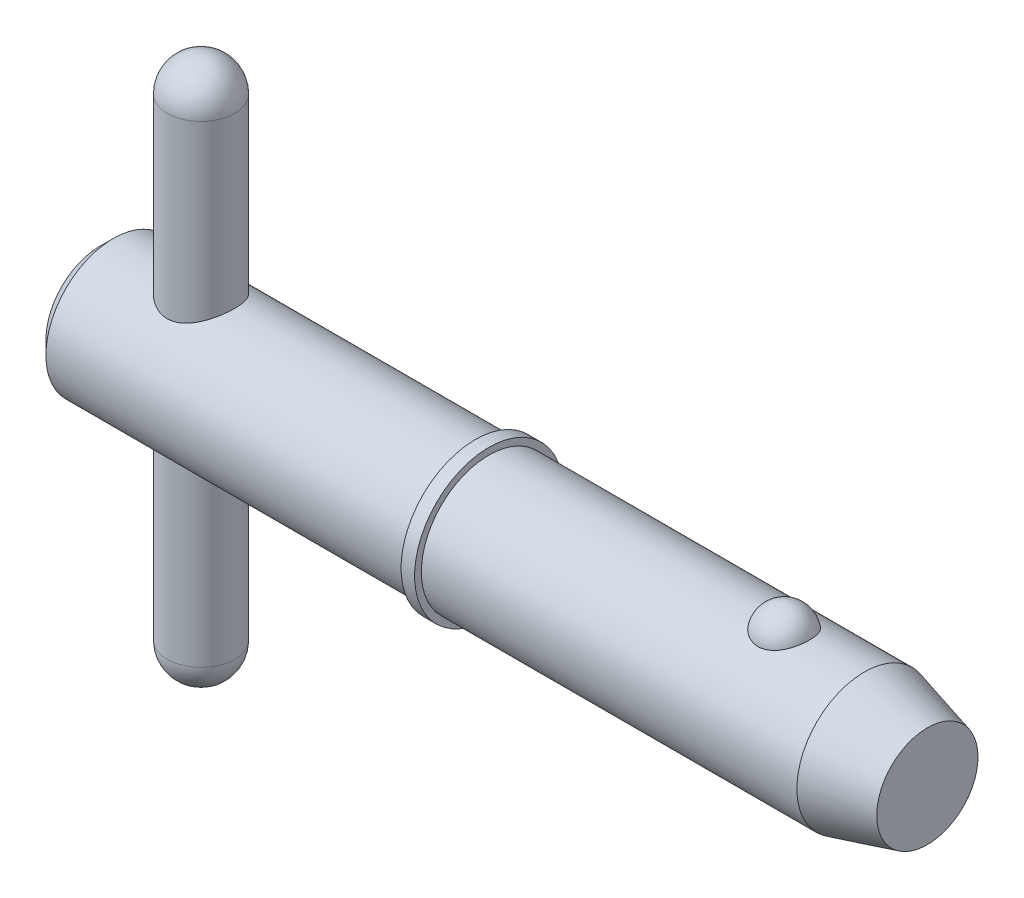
ISO-10303-21;
HEADER;
FILE_DESCRIPTION(('STEP AP214'),'2;1');
FILE_NAME('part.step','',(''),(''),'','','');
FILE_SCHEMA(('AUTOMOTIVE_DESIGN { 1 0 10303 214 1 1 1 1 }'));
ENDSEC;
DATA;
#1=APPLICATION_CONTEXT('core data for automotive mechanical design processes');
#2=APPLICATION_PROTOCOL_DEFINITION('international standard','automotive_design',2000,#1);
#3=PRODUCT_CONTEXT('',#1,'mechanical');
#4=PRODUCT('Part','Part','',(#3));
#5=PRODUCT_RELATED_PRODUCT_CATEGORY('part','',(#4));
#6=PRODUCT_DEFINITION_FORMATION('','',#4);
#7=PRODUCT_DEFINITION_CONTEXT('part definition',#1,'design');
#8=PRODUCT_DEFINITION('design','',#6,#7);
#9=PRODUCT_DEFINITION_SHAPE('','',#8);
#10=(LENGTH_UNIT() NAMED_UNIT(*) SI_UNIT(.MILLI.,.METRE.));
#11=(NAMED_UNIT(*) PLANE_ANGLE_UNIT() SI_UNIT($,.RADIAN.));
#12=(NAMED_UNIT(*) SI_UNIT($,.STERADIAN.) SOLID_ANGLE_UNIT());
#13=UNCERTAINTY_MEASURE_WITH_UNIT(LENGTH_MEASURE(1.E-05),#10,'distance_accuracy_value','');
#14=(GEOMETRIC_REPRESENTATION_CONTEXT(3) GLOBAL_UNCERTAINTY_ASSIGNED_CONTEXT((#13)) GLOBAL_UNIT_ASSIGNED_CONTEXT((#10,
#11,#12)) REPRESENTATION_CONTEXT('',''));
#15=CARTESIAN_POINT('',(0.,0.,0.));
#16=DIRECTION('',(0.,0.,1.));
#17=DIRECTION('',(1.,0.,0.));
#18=AXIS2_PLACEMENT_3D('',#15,#16,#17);
#19=CARTESIAN_POINT('',(4.755,12.7,0.));
#20=DIRECTION('',(0.,-1.,0.));
#21=DIRECTION('',(0.,0.,-1.));
#22=AXIS2_PLACEMENT_3D('',#19,#20,#21);
#23=CYLINDRICAL_SURFACE('',#22,1.585);
#24=CARTESIAN_POINT('',(4.755,-11.115,0.));
#25=DIRECTION('',(0.,-1.,0.));
#26=DIRECTION('',(0.,0.,-1.));
#27=AXIS2_PLACEMENT_3D('',#24,#25,#26);
#28=CIRCLE('',#27,1.585);
#29=CARTESIAN_POINT('',(4.755,-11.115,-1.585));
#30=VERTEX_POINT('',#29);
#31=EDGE_CURVE('P0_E10',#30,#30,#28,.F.);
#32=ORIENTED_EDGE('',*,*,#31,.T.);
#33=EDGE_LOOP('',(#32));
#34=FACE_BOUND('',#33,.T.);
#35=CARTESIAN_POINT('',(4.755,11.115,0.));
#36=DIRECTION('',(0.,-1.,0.));
#37=DIRECTION('',(0.,0.,-1.));
#38=AXIS2_PLACEMENT_3D('',#35,#36,#37);
#39=CIRCLE('',#38,1.585);
#40=CARTESIAN_POINT('',(4.755,11.115,-1.585));
#41=VERTEX_POINT('',#40);
#42=EDGE_CURVE('P0_E21',#41,#41,#39,.T.);
#43=ORIENTED_EDGE('',*,*,#42,.T.);
#44=EDGE_LOOP('',(#43));
#45=FACE_BOUND('',#44,.T.);
#46=ADVANCED_FACE('P0_F14',(#34,#45),#23,.T.);
#47=CARTESIAN_POINT('',(4.755,-11.115,0.));
#48=DIRECTION('',(0.,0.,1.));
#49=DIRECTION('',(1.,0.,0.));
#50=AXIS2_PLACEMENT_3D('',#47,#48,#49);
#51=SPHERICAL_SURFACE('',#50,1.585);
#52=CARTESIAN_POINT('',(4.755,-11.115,0.));
#53=DIRECTION('',(0.,-1.,0.));
#54=DIRECTION('',(0.,0.,-1.));
#55=AXIS2_PLACEMENT_3D('',#52,#53,#54);
#56=SPHERICAL_SURFACE('',#55,1.585);
#57=ORIENTED_EDGE('',*,*,#31,.F.);
#58=EDGE_LOOP('',(#57));
#59=FACE_BOUND('',#58,.T.);
#60=ADVANCED_FACE('P0_F29',(#59),#56,.T.);
#61=CARTESIAN_POINT('',(4.755,11.115,0.));
#62=DIRECTION('',(0.,0.,1.));
#63=DIRECTION('',(1.,0.,0.));
#64=AXIS2_PLACEMENT_3D('',#61,#62,#63);
#65=SPHERICAL_SURFACE('',#64,1.585);
#66=CARTESIAN_POINT('',(4.755,11.115,0.));
#67=DIRECTION('',(0.,-1.,0.));
#68=DIRECTION('',(0.,0.,-1.));
#69=AXIS2_PLACEMENT_3D('',#66,#67,#68);
#70=SPHERICAL_SURFACE('',#69,1.585);
#71=ORIENTED_EDGE('',*,*,#42,.F.);
#72=EDGE_LOOP('',(#71));
#73=FACE_BOUND('',#72,.T.);
#74=ADVANCED_FACE('P0_F16',(#73),#70,.T.);
#75=CLOSED_SHELL('',(#46,#60,#74));
#76=MANIFOLD_SOLID_BREP('P0_B1',#75);
#77=CARTESIAN_POINT('',(0.,0.,0.));
#78=DIRECTION('',(1.,0.,0.));
#79=DIRECTION('',(0.,0.,-1.));
#80=AXIS2_PLACEMENT_3D('',#77,#78,#79);
#81=CYLINDRICAL_SURFACE('',#80,3.175);
#82=CARTESIAN_POINT('',(35.9476846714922,0.,0.));
#83=DIRECTION('',(1.,0.,0.));
#84=DIRECTION('',(0.,0.,-1.));
#85=AXIS2_PLACEMENT_3D('',#82,#83,#84);
#86=CIRCLE('',#85,3.175);
#87=CARTESIAN_POINT('',(35.9476846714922,0.,-3.175));
#88=VERTEX_POINT('',#87);
#89=EDGE_CURVE('P1_E81',#88,#88,#86,.T.);
#90=ORIENTED_EDGE('',*,*,#89,.F.);
#91=EDGE_LOOP('',(#90));
#92=FACE_BOUND('',#91,.T.);
#93=CARTESIAN_POINT('',(18.29,0.,0.));
#94=DIRECTION('',(1.,0.,0.));
#95=DIRECTION('',(0.,0.,-1.));
#96=AXIS2_PLACEMENT_3D('',#93,#94,#95);
#97=CIRCLE('',#96,3.175);
#98=CARTESIAN_POINT('',(18.29,0.,-3.175));
#99=VERTEX_POINT('',#98);
#100=EDGE_CURVE('P1_E85',#99,#99,#97,.T.);
#101=ORIENTED_EDGE('',*,*,#100,.T.);
#102=EDGE_LOOP('',(#101));
#103=FACE_BOUND('',#102,.T.);
#104=CARTESIAN_POINT('',(32.1757276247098,2.92898950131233,1.2254164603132));
#105=CARTESIAN_POINT('',(32.112316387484,2.92899434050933,1.22541146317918));
#106=CARTESIAN_POINT('',(32.0487979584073,2.93112688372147,1.2203464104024));
#107=CARTESIAN_POINT('',(31.9235306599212,2.93942752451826,1.20020949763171));
#108=CARTESIAN_POINT('',(31.8617869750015,2.9456063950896,1.18511092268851));
#109=CARTESIAN_POINT('',(31.7420651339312,2.96127115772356,1.14540352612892));
#110=CARTESIAN_POINT('',(31.6840775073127,2.97074831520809,1.12081980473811));
#111=CARTESIAN_POINT('',(31.5731943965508,2.99197584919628,1.06285154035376));
#112=CARTESIAN_POINT('',(31.5202966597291,3.0037252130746,1.0294709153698));
#113=CARTESIAN_POINT('',(31.4192688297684,3.02865714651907,0.95367409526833));
#114=CARTESIAN_POINT('',(31.371324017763,3.04187163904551,0.911021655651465));
#115=CARTESIAN_POINT('',(31.2830360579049,3.06808741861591,0.818400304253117));
#116=CARTESIAN_POINT('',(31.2426952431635,3.08108863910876,0.768429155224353));
#117=CARTESIAN_POINT('',(31.1688039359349,3.10614903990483,0.660064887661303));
#118=CARTESIAN_POINT('',(31.1356330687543,3.11814104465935,0.601396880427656));
#119=CARTESIAN_POINT('',(31.0791190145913,3.13926931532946,0.479026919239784));
#120=CARTESIAN_POINT('',(31.0557764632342,3.14840539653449,0.415324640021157));
#121=CARTESIAN_POINT('',(31.0191785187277,3.16298160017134,0.283885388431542));
#122=CARTESIAN_POINT('',(31.0060407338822,3.16837855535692,0.216110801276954));
#123=CARTESIAN_POINT('',(30.9905676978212,3.17475386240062,0.0791367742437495));
#124=CARTESIAN_POINT('',(30.988232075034,3.17573236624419,0.00993738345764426));
#125=CARTESIAN_POINT('',(30.994388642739,3.17318075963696,-0.127420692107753));
#126=CARTESIAN_POINT('',(31.0028073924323,3.16968122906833,-0.195583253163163));
#127=CARTESIAN_POINT('',(31.0301752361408,3.1585790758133,-0.329413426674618));
#128=CARTESIAN_POINT('',(31.0491245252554,3.15097637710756,-0.395080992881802));
#129=CARTESIAN_POINT('',(31.0972057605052,3.13242485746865,-0.522180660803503));
#130=CARTESIAN_POINT('',(31.1263524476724,3.12147119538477,-0.583606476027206));
#131=CARTESIAN_POINT('',(31.1942352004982,3.09734973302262,-0.700436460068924));
#132=CARTESIAN_POINT('',(31.232972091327,3.08418174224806,-0.755840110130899));
#133=CARTESIAN_POINT('',(31.3194771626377,3.05694884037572,-0.859404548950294));
#134=CARTESIAN_POINT('',(31.3672961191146,3.04287919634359,-0.907521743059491));
#135=CARTESIAN_POINT('',(31.4707353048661,3.01548927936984,-0.994758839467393));
#136=CARTESIAN_POINT('',(31.5263549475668,3.00216895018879,-1.03387941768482));
#137=CARTESIAN_POINT('',(31.6428093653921,2.97810316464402,-1.10126594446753));
#138=CARTESIAN_POINT('',(31.7035182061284,2.96731170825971,-1.12973256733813));
#139=CARTESIAN_POINT('',(31.8293712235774,2.9492893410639,-1.17598467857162));
#140=CARTESIAN_POINT('',(31.8945137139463,2.94205708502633,-1.19377420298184));
#141=CARTESIAN_POINT('',(32.0238562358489,2.93233065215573,-1.21746387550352));
#142=CARTESIAN_POINT('',(32.0879385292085,2.92961621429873,-1.22391763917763));
#143=CARTESIAN_POINT('',(32.2163375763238,2.92855752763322,-1.22644976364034));
#144=CARTESIAN_POINT('',(32.2806542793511,2.93021238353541,-1.22253024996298));
#145=CARTESIAN_POINT('',(32.4055239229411,2.9375685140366,-1.20474140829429));
#146=CARTESIAN_POINT('',(32.466131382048,2.94313790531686,-1.19119621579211));
#147=CARTESIAN_POINT('',(32.5841106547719,2.95756226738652,-1.15491492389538));
#148=CARTESIAN_POINT('',(32.6414822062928,2.96641750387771,-1.13217808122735));
#149=CARTESIAN_POINT('',(32.7527699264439,2.98669918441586,-1.07755083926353));
#150=CARTESIAN_POINT('',(32.8065845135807,2.9981771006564,-1.0454730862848));
#151=CARTESIAN_POINT('',(32.9081473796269,3.02240235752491,-0.973220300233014));
#152=CARTESIAN_POINT('',(32.9558942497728,3.03514999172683,-0.933043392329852));
#153=CARTESIAN_POINT('',(33.0465817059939,3.06131230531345,-0.843372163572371));
#154=CARTESIAN_POINT('',(33.0891588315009,3.07472822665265,-0.793510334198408));
#155=CARTESIAN_POINT('',(33.1656765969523,3.10021106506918,-0.687241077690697));
#156=CARTESIAN_POINT('',(33.1996156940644,3.1122777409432,-0.630832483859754));
#157=CARTESIAN_POINT('',(33.2591209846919,3.134208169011,-0.511059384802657));
#158=CARTESIAN_POINT('',(33.2843892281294,3.14399040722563,-0.447531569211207));
#159=CARTESIAN_POINT('',(33.3245117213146,3.15983820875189,-0.316827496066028));
#160=CARTESIAN_POINT('',(33.3393659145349,3.16590375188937,-0.249651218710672));
#161=CARTESIAN_POINT('',(33.358358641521,3.17370076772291,-0.11354918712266));
#162=CARTESIAN_POINT('',(33.3624966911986,3.17543204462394,-0.0446233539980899));
#163=CARTESIAN_POINT('',(33.3599697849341,3.17438372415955,0.0929938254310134));
#164=CARTESIAN_POINT('',(33.3533050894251,3.17160423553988,0.161685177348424));
#165=CARTESIAN_POINT('',(33.3293754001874,3.1618438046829,0.296502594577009));
#166=CARTESIAN_POINT('',(33.3121674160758,3.15488546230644,0.362640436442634));
#167=CARTESIAN_POINT('',(33.267547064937,3.13748892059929,0.490896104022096));
#168=CARTESIAN_POINT('',(33.2401339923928,3.12705048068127,0.553013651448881));
#169=CARTESIAN_POINT('',(33.1754626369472,3.10369139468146,0.671876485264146));
#170=CARTESIAN_POINT('',(33.1381467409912,3.0907563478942,0.728587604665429));
#171=CARTESIAN_POINT('',(33.0545246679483,3.06381731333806,0.834653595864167));
#172=CARTESIAN_POINT('',(33.0082189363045,3.04981337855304,0.884008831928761));
#173=CARTESIAN_POINT('',(32.9077184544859,3.02230423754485,0.973916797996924));
#174=CARTESIAN_POINT('',(32.853535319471,3.00879833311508,1.01448227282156));
#175=CARTESIAN_POINT('',(32.7385299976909,2.98383625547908,1.0857155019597));
#176=CARTESIAN_POINT('',(32.6777053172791,2.9723808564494,1.11637952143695));
#177=CARTESIAN_POINT('',(32.5533690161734,2.95329063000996,1.16592590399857));
#178=CARTESIAN_POINT('',(32.4900230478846,2.9455373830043,1.18517901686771));
#179=CARTESIAN_POINT('',(32.3607664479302,2.9342556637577,1.21284802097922));
#180=CARTESIAN_POINT('',(32.2948641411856,2.93071450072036,1.2212964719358));
#181=CARTESIAN_POINT('',(32.211116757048,2.9291525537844,1.22502505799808));
#182=CARTESIAN_POINT('',(32.1934263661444,2.92898815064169,1.22541785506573));
#183=CARTESIAN_POINT('',(32.1757276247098,2.92898950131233,1.2254164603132));
#184=B_SPLINE_CURVE_WITH_KNOTS('',3,(#104,#105,#106,#107,#108,#109,#110,#111,#112,#113,#114,
#115,#116,#117,#118,#119,#120,#121,#122,#123,#124,#125,#126,#127,#128,#129,#130,#131,#132,#133,
#134,#135,#136,#137,#138,#139,#140,#141,#142,#143,#144,#145,#146,#147,#148,#149,#150,#151,#152,
#153,#154,#155,#156,#157,#158,#159,#160,#161,#162,#163,#164,#165,#166,#167,#168,#169,#170,#171,
#172,#173,#174,#175,#176,#177,#178,#179,#180,#181,#182,#183),.UNSPECIFIED.,.T.,.F.,(4,2,2,2,2,2,
2,2,2,2,2,2,2,2,2,2,2,2,2,2,2,2,2,2,2,2,2,2,2,2,2,2,2,2,2,2,2,2,2,4),(0.,0.190186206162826,
0.380880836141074,0.571074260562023,0.761183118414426,0.956866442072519,1.1526097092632,
1.3570177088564,1.56143892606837,1.76818248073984,1.97491892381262,2.18025109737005,
2.38558707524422,2.59122111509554,2.79687285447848,3.00371012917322,3.2105318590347,
3.41323429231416,3.61586005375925,3.80828192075,4.00066436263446,4.18685798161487,
4.37306665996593,4.56330302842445,4.75358348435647,4.95345287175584,5.15335793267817,
5.35957003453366,5.56578325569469,5.77200579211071,5.97822335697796,6.183335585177,
6.38846199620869,6.59480900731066,6.80114579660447,7.00718137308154,7.21329457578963,
7.41228022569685,7.61066481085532,7.66374777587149),.UNSPECIFIED.);
#185=CARTESIAN_POINT('',(32.1757276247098,2.92898950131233,1.2254164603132));
#186=VERTEX_POINT('',#185);
#187=EDGE_CURVE('P1_E35',#186,#186,#184,.T.);
#188=ORIENTED_EDGE('',*,*,#187,.T.);
#189=EDGE_LOOP('',(#188));
#190=FACE_BOUND('',#189,.T.);
#191=ADVANCED_FACE('P1_F13',(#92,#103,#190),#81,.T.);
#192=CARTESIAN_POINT('',(0.,0.,0.));
#193=DIRECTION('',(-1.,0.,0.));
#194=DIRECTION('',(0.,0.,1.));
#195=AXIS2_PLACEMENT_3D('',#192,#193,#194);
#196=PLANE('',#195);
#197=CARTESIAN_POINT('',(0.,0.,0.));
#198=DIRECTION('',(1.,0.,0.));
#199=DIRECTION('',(0.,0.,-1.));
#200=AXIS2_PLACEMENT_3D('',#197,#198,#199);
#201=CIRCLE('',#200,2.54);
#202=CARTESIAN_POINT('',(0.,0.,-2.54));
#203=VERTEX_POINT('',#202);
#204=EDGE_CURVE('P1_E9',#203,#203,#201,.T.);
#205=ORIENTED_EDGE('',*,*,#204,.F.);
#206=EDGE_LOOP('',(#205));
#207=FACE_BOUND('',#206,.T.);
#208=ADVANCED_FACE('P1_F15',(#207),#196,.T.);
#209=CARTESIAN_POINT('',(0.634999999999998,0.,0.));
#210=DIRECTION('',(1.,0.,0.));
#211=DIRECTION('',(0.,0.,-1.));
#212=AXIS2_PLACEMENT_3D('',#209,#210,#211);
#213=CONICAL_SURFACE('',#212,3.175,0.78539816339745);
#214=ORIENTED_EDGE('',*,*,#204,.T.);
#215=EDGE_LOOP('',(#214));
#216=FACE_BOUND('',#215,.T.);
#217=CARTESIAN_POINT('',(0.634999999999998,0.,0.));
#218=DIRECTION('',(1.,0.,0.));
#219=DIRECTION('',(0.,0.,-1.));
#220=AXIS2_PLACEMENT_3D('',#217,#218,#219);
#221=CIRCLE('',#220,3.175);
#222=CARTESIAN_POINT('',(0.634999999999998,0.,-3.175));
#223=VERTEX_POINT('',#222);
#224=EDGE_CURVE('P1_E26',#223,#223,#221,.T.);
#225=ORIENTED_EDGE('',*,*,#224,.F.);
#226=EDGE_LOOP('',(#225));
#227=FACE_BOUND('',#226,.T.);
#228=ADVANCED_FACE('P1_F77',(#216,#227),#213,.T.);
#229=CARTESIAN_POINT('',(0.,0.,0.));
#230=DIRECTION('',(1.,0.,0.));
#231=DIRECTION('',(0.,0.,-1.));
#232=AXIS2_PLACEMENT_3D('',#229,#230,#231);
#233=CYLINDRICAL_SURFACE('',#232,3.175);
#234=CARTESIAN_POINT('',(4.755,-2.75107251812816,1.585));
#235=CARTESIAN_POINT('',(4.67238891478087,-2.7510796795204,1.58499425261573));
#236=CARTESIAN_POINT('',(4.58967306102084,-2.75485010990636,1.57849830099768));
#237=CARTESIAN_POINT('',(4.42677850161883,-2.76938647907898,1.55284486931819));
#238=CARTESIAN_POINT('',(4.34660551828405,-2.78016716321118,1.53366069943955));
#239=CARTESIAN_POINT('',(4.19146029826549,-2.80716278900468,1.48366329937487));
#240=CARTESIAN_POINT('',(4.11646293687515,-2.8233488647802,1.45291173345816));
#241=CARTESIAN_POINT('',(3.97271079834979,-2.85928672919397,1.38084067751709));
#242=CARTESIAN_POINT('',(3.90395634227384,-2.87903870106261,1.33952064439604));
#243=CARTESIAN_POINT('',(3.76839976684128,-2.921867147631,1.24350234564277));
#244=CARTESIAN_POINT('',(3.702222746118,-2.94508343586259,1.18798355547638));
#245=CARTESIAN_POINT('',(3.5796334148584,-2.99109588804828,1.06685014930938));
#246=CARTESIAN_POINT('',(3.52322596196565,-3.01389183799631,1.00123054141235));
#247=CARTESIAN_POINT('',(3.41807024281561,-3.05832598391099,0.856373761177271));
#248=CARTESIAN_POINT('',(3.37009053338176,-3.07978367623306,0.776518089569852));
#249=CARTESIAN_POINT('',(3.28853137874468,-3.11730894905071,0.608596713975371));
#250=CARTESIAN_POINT('',(3.25494287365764,-3.1333799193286,0.520536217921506));
#251=CARTESIAN_POINT('',(3.20559401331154,-3.15731341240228,0.345327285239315));
#252=CARTESIAN_POINT('',(3.18873760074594,-3.16567752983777,0.258557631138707));
#253=CARTESIAN_POINT('',(3.16972238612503,-3.17512718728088,0.0830496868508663));
#254=CARTESIAN_POINT('',(3.16755472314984,-3.17621711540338,-0.00568738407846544));
#255=CARTESIAN_POINT('',(3.1775542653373,-3.17123385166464,-0.174372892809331));
#256=CARTESIAN_POINT('',(3.18849502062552,-3.16577346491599,-0.254416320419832));
#257=CARTESIAN_POINT('',(3.22220680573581,-3.14922844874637,-0.411354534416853));
#258=CARTESIAN_POINT('',(3.2449787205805,-3.13814339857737,-0.488249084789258));
#259=CARTESIAN_POINT('',(3.30185558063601,-3.111172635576,-0.638050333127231));
#260=CARTESIAN_POINT('',(3.33611332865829,-3.09522247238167,-0.710886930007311));
#261=CARTESIAN_POINT('',(3.41477890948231,-3.05996035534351,-0.849953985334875));
#262=CARTESIAN_POINT('',(3.45919037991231,-3.04064719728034,-0.916182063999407));
#263=CARTESIAN_POINT('',(3.5617148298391,-2.99832415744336,-1.04681642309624));
#264=CARTESIAN_POINT('',(3.62072497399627,-2.97513741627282,-1.11046186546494));
#265=CARTESIAN_POINT('',(3.7483697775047,-2.92885066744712,-1.22736291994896));
#266=CARTESIAN_POINT('',(3.81701173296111,-2.90575073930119,-1.2806105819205));
#267=CARTESIAN_POINT('',(3.96727993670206,-2.86067370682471,-1.37849835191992));
#268=CARTESIAN_POINT('',(4.04945242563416,-2.83885964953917,-1.42238246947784));
#269=CARTESIAN_POINT('',(4.2213558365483,-2.80110454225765,-1.49537418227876));
#270=CARTESIAN_POINT('',(4.3110787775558,-2.78515738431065,-1.52449715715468));
#271=CARTESIAN_POINT('',(4.48806324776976,-2.76271292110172,-1.56478065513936));
#272=CARTESIAN_POINT('',(4.57495732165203,-2.75556745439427,-1.57718067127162));
#273=CARTESIAN_POINT('',(4.74985771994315,-2.74969306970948,-1.58740564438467));
#274=CARTESIAN_POINT('',(4.8378632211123,-2.75095824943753,-1.58524082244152));
#275=CARTESIAN_POINT('',(5.00227282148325,-2.76107477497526,-1.56753530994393));
#276=CARTESIAN_POINT('',(5.07889680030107,-2.76908515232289,-1.55347662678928));
#277=CARTESIAN_POINT('',(5.22855309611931,-2.79054849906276,-1.51458035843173));
#278=CARTESIAN_POINT('',(5.30158424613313,-2.80400322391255,-1.489739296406));
#279=CARTESIAN_POINT('',(5.44583114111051,-2.83556995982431,-1.42877335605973));
#280=CARTESIAN_POINT('',(5.51680600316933,-2.85386886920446,-1.39217900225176));
#281=CARTESIAN_POINT('',(5.6520174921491,-2.89289503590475,-1.30915485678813));
#282=CARTESIAN_POINT('',(5.71625063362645,-2.91362353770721,-1.26272001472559));
#283=CARTESIAN_POINT('',(5.8445938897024,-2.95830220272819,-1.15451693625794));
#284=CARTESIAN_POINT('',(5.90767560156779,-2.98233004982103,-1.09155543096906));
#285=CARTESIAN_POINT('',(6.0226995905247,-3.02864458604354,-0.955560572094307));
#286=CARTESIAN_POINT('',(6.07463814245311,-3.05093069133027,-0.882523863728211));
#287=CARTESIAN_POINT('',(6.16704288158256,-3.09200671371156,-0.725836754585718));
#288=CARTESIAN_POINT('',(6.20717458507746,-3.11069030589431,-0.64195924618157));
#289=CARTESIAN_POINT('',(6.27235859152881,-3.1416474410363,-0.467442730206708));
#290=CARTESIAN_POINT('',(6.29742409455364,-3.15392659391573,-0.376809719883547));
#291=CARTESIAN_POINT('',(6.32960989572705,-3.16979844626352,-0.200314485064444));
#292=CARTESIAN_POINT('',(6.33816324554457,-3.17408359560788,-0.114775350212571));
#293=CARTESIAN_POINT('',(6.34130309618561,-3.17565001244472,0.0566108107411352));
#294=CARTESIAN_POINT('',(6.33589445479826,-3.17293371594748,0.142457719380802));
#295=CARTESIAN_POINT('',(6.31221457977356,-3.16120608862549,0.306097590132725));
#296=CARTESIAN_POINT('',(6.2948097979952,-3.15261910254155,0.38404960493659));
#297=CARTESIAN_POINT('',(6.24879775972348,-3.13040364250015,0.535801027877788));
#298=CARTESIAN_POINT('',(6.22018889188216,-3.11677444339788,0.609599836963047));
#299=CARTESIAN_POINT('',(6.15130303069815,-3.08497808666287,0.754502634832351));
#300=CARTESIAN_POINT('',(6.11057850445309,-3.0666414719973,0.82535556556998));
#301=CARTESIAN_POINT('',(6.01917980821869,-3.02735012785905,0.95951596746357));
#302=CARTESIAN_POINT('',(5.96850106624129,-3.00639419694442,1.02281994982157));
#303=CARTESIAN_POINT('',(5.8528006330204,-2.96149402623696,1.1467073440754));
#304=CARTESIAN_POINT('',(5.78685463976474,-2.93745961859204,1.20639723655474));
#305=CARTESIAN_POINT('',(5.64552278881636,-2.89084502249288,1.31419099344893));
#306=CARTESIAN_POINT('',(5.57012871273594,-2.8682661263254,1.36228466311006));
#307=CARTESIAN_POINT('',(5.40892145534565,-2.82661780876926,1.44677201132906));
#308=CARTESIAN_POINT('',(5.32285703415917,-2.80767948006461,1.48275497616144));
#309=CARTESIAN_POINT('',(5.14469010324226,-2.77716572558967,1.53916557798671));
#310=CARTESIAN_POINT('',(5.05260892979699,-2.76556569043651,1.55964525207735));
#311=CARTESIAN_POINT('',(4.92544162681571,-2.75613775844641,1.57618070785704));
#312=CARTESIAN_POINT('',(4.89147210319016,-2.75424493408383,1.57948285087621));
#313=CARTESIAN_POINT('',(4.82334103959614,-2.75171079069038,1.58389375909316));
#314=CARTESIAN_POINT('',(4.78917948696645,-2.75106955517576,1.58500237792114));
#315=CARTESIAN_POINT('',(4.755,-2.75107251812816,1.585));
#316=B_SPLINE_CURVE_WITH_KNOTS('',3,(#234,#235,#236,#237,#238,#239,#240,#241,#242,#243,#244,
#245,#246,#247,#248,#249,#250,#251,#252,#253,#254,#255,#256,#257,#258,#259,#260,#261,#262,#263,
#264,#265,#266,#267,#268,#269,#270,#271,#272,#273,#274,#275,#276,#277,#278,#279,#280,#281,#282,
#283,#284,#285,#286,#287,#288,#289,#290,#291,#292,#293,#294,#295,#296,#297,#298,#299,#300,#301,
#302,#303,#304,#305,#306,#307,#308,#309,#310,#311,#312,#313,#314,#315),.UNSPECIFIED.,.T.,.F.,(4,
2,2,2,2,2,2,2,2,2,2,2,2,2,2,2,2,2,2,2,2,2,2,2,2,2,2,2,2,2,2,2,2,2,2,2,2,2,2,2,4),(0.,
0.247689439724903,0.495901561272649,0.742808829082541,0.989728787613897,1.25694656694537,
1.52429683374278,1.80959781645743,2.0947189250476,2.35960564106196,2.62433255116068,
2.86610932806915,3.1079041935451,3.35305262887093,3.59828902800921,3.86665310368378,
4.13522157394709,4.4207514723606,4.70598326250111,4.9686344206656,5.23110127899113,
5.46499114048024,5.69895647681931,5.94376186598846,6.1886932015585,6.46438263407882,
6.74016408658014,7.0231370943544,7.30586181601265,7.5626977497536,7.81944433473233,
8.05935987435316,8.29930993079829,8.54954401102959,8.79989329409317,9.07508848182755,
9.35052473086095,9.63453318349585,9.91758407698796,10.0200561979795,10.1225351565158),.UNSPECIFIED.);
#317=CARTESIAN_POINT('',(4.755,-2.75107251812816,1.585));
#318=VERTEX_POINT('',#317);
#319=EDGE_CURVE('P1_E17',#318,#318,#316,.T.);
#320=ORIENTED_EDGE('',*,*,#319,.F.);
#321=EDGE_LOOP('',(#320));
#322=FACE_BOUND('',#321,.T.);
#323=CARTESIAN_POINT('',(4.755,2.75107251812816,1.585));
#324=CARTESIAN_POINT('',(4.83761108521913,2.7510796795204,1.58499425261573));
#325=CARTESIAN_POINT('',(4.92032693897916,2.75485010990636,1.57849830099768));
#326=CARTESIAN_POINT('',(5.08322149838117,2.76938647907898,1.55284486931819));
#327=CARTESIAN_POINT('',(5.16339448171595,2.78016716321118,1.53366069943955));
#328=CARTESIAN_POINT('',(5.31853970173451,2.80716278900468,1.48366329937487));
#329=CARTESIAN_POINT('',(5.39353706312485,2.8233488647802,1.45291173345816));
#330=CARTESIAN_POINT('',(5.53728920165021,2.85928672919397,1.38084067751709));
#331=CARTESIAN_POINT('',(5.60604365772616,2.87903870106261,1.33952064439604));
#332=CARTESIAN_POINT('',(5.74160023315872,2.921867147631,1.24350234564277));
#333=CARTESIAN_POINT('',(5.807777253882,2.94508343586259,1.18798355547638));
#334=CARTESIAN_POINT('',(5.9303665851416,2.99109588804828,1.06685014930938));
#335=CARTESIAN_POINT('',(5.98677403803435,3.01389183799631,1.00123054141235));
#336=CARTESIAN_POINT('',(6.09192975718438,3.05832598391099,0.85637376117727));
#337=CARTESIAN_POINT('',(6.13990946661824,3.07978367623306,0.776518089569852));
#338=CARTESIAN_POINT('',(6.22146862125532,3.11730894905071,0.608596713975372));
#339=CARTESIAN_POINT('',(6.25505712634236,3.1333799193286,0.520536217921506));
#340=CARTESIAN_POINT('',(6.30440598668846,3.15731341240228,0.345327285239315));
#341=CARTESIAN_POINT('',(6.32126239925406,3.16567752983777,0.258557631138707));
#342=CARTESIAN_POINT('',(6.34027761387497,3.17512718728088,0.0830496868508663));
#343=CARTESIAN_POINT('',(6.34244527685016,3.17621711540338,-0.00568738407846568));
#344=CARTESIAN_POINT('',(6.3324457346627,3.17123385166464,-0.174372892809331));
#345=CARTESIAN_POINT('',(6.32150497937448,3.16577346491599,-0.254416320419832));
#346=CARTESIAN_POINT('',(6.28779319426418,3.14922844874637,-0.411354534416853));
#347=CARTESIAN_POINT('',(6.2650212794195,3.13814339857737,-0.488249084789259));
#348=CARTESIAN_POINT('',(6.20814441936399,3.111172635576,-0.638050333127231));
#349=CARTESIAN_POINT('',(6.17388667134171,3.09522247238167,-0.710886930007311));
#350=CARTESIAN_POINT('',(6.09522109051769,3.05996035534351,-0.849953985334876));
#351=CARTESIAN_POINT('',(6.05080962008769,3.04064719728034,-0.916182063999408));
#352=CARTESIAN_POINT('',(5.9482851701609,2.99832415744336,-1.04681642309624));
#353=CARTESIAN_POINT('',(5.88927502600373,2.97513741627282,-1.11046186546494));
#354=CARTESIAN_POINT('',(5.7616302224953,2.92885066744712,-1.22736291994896));
#355=CARTESIAN_POINT('',(5.69298826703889,2.90575073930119,-1.2806105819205));
#356=CARTESIAN_POINT('',(5.54272006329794,2.86067370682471,-1.37849835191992));
#357=CARTESIAN_POINT('',(5.46054757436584,2.83885964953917,-1.42238246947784));
#358=CARTESIAN_POINT('',(5.2886441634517,2.80110454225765,-1.49537418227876));
#359=CARTESIAN_POINT('',(5.19892122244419,2.78515738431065,-1.52449715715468));
#360=CARTESIAN_POINT('',(5.02193675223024,2.76271292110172,-1.56478065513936));
#361=CARTESIAN_POINT('',(4.93504267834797,2.75556745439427,-1.57718067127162));
#362=CARTESIAN_POINT('',(4.76014228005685,2.74969306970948,-1.58740564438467));
#363=CARTESIAN_POINT('',(4.6721367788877,2.75095824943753,-1.58524082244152));
#364=CARTESIAN_POINT('',(4.50772717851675,2.76107477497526,-1.56753530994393));
#365=CARTESIAN_POINT('',(4.43110319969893,2.76908515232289,-1.55347662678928));
#366=CARTESIAN_POINT('',(4.28144690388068,2.79054849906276,-1.51458035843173));
#367=CARTESIAN_POINT('',(4.20841575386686,2.80400322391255,-1.489739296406));
#368=CARTESIAN_POINT('',(4.06416885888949,2.83556995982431,-1.42877335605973));
#369=CARTESIAN_POINT('',(3.99319399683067,2.85386886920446,-1.39217900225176));
#370=CARTESIAN_POINT('',(3.8579825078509,2.89289503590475,-1.30915485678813));
#371=CARTESIAN_POINT('',(3.79374936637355,2.91362353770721,-1.26272001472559));
#372=CARTESIAN_POINT('',(3.6654061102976,2.95830220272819,-1.15451693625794));
#373=CARTESIAN_POINT('',(3.60232439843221,2.98233004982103,-1.09155543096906));
#374=CARTESIAN_POINT('',(3.4873004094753,3.02864458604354,-0.955560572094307));
#375=CARTESIAN_POINT('',(3.43536185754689,3.05093069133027,-0.88252386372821));
#376=CARTESIAN_POINT('',(3.34295711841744,3.09200671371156,-0.725836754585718));
#377=CARTESIAN_POINT('',(3.30282541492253,3.11069030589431,-0.64195924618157));
#378=CARTESIAN_POINT('',(3.23764140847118,3.14164744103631,-0.467442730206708));
#379=CARTESIAN_POINT('',(3.21257590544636,3.15392659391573,-0.376809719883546));
#380=CARTESIAN_POINT('',(3.18039010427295,3.16979844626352,-0.200314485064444));
#381=CARTESIAN_POINT('',(3.17183675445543,3.17408359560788,-0.114775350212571));
#382=CARTESIAN_POINT('',(3.16869690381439,3.17565001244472,0.0566108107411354));
#383=CARTESIAN_POINT('',(3.17410554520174,3.17293371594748,0.142457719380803));
#384=CARTESIAN_POINT('',(3.19778542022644,3.16120608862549,0.306097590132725));
#385=CARTESIAN_POINT('',(3.2151902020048,3.15261910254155,0.384049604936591));
#386=CARTESIAN_POINT('',(3.26120224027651,3.13040364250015,0.535801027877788));
#387=CARTESIAN_POINT('',(3.28981110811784,3.11677444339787,0.609599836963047));
#388=CARTESIAN_POINT('',(3.35869696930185,3.08497808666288,0.754502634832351));
#389=CARTESIAN_POINT('',(3.39942149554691,3.0666414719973,0.82535556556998));
#390=CARTESIAN_POINT('',(3.49082019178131,3.02735012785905,0.95951596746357));
#391=CARTESIAN_POINT('',(3.54149893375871,3.00639419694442,1.02281994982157));
#392=CARTESIAN_POINT('',(3.6571993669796,2.96149402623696,1.1467073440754));
#393=CARTESIAN_POINT('',(3.72314536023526,2.93745961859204,1.20639723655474));
#394=CARTESIAN_POINT('',(3.86447721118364,2.89084502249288,1.31419099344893));
#395=CARTESIAN_POINT('',(3.93987128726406,2.8682661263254,1.36228466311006));
#396=CARTESIAN_POINT('',(4.10107854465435,2.82661780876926,1.44677201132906));
#397=CARTESIAN_POINT('',(4.18714296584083,2.80767948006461,1.48275497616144));
#398=CARTESIAN_POINT('',(4.36530989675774,2.77716572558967,1.53916557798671));
#399=CARTESIAN_POINT('',(4.45739107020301,2.76556569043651,1.55964525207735));
#400=CARTESIAN_POINT('',(4.58455837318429,2.75613775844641,1.57618070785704));
#401=CARTESIAN_POINT('',(4.61852789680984,2.75424493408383,1.57948285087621));
#402=CARTESIAN_POINT('',(4.68665896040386,2.75171079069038,1.58389375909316));
#403=CARTESIAN_POINT('',(4.72082051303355,2.75106955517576,1.58500237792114));
#404=CARTESIAN_POINT('',(4.755,2.75107251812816,1.585));
#405=B_SPLINE_CURVE_WITH_KNOTS('',3,(#323,#324,#325,#326,#327,#328,#329,#330,#331,#332,#333,
#334,#335,#336,#337,#338,#339,#340,#341,#342,#343,#344,#345,#346,#347,#348,#349,#350,#351,#352,
#353,#354,#355,#356,#357,#358,#359,#360,#361,#362,#363,#364,#365,#366,#367,#368,#369,#370,#371,
#372,#373,#374,#375,#376,#377,#378,#379,#380,#381,#382,#383,#384,#385,#386,#387,#388,#389,#390,
#391,#392,#393,#394,#395,#396,#397,#398,#399,#400,#401,#402,#403,#404),.UNSPECIFIED.,.T.,.F.,(4,
2,2,2,2,2,2,2,2,2,2,2,2,2,2,2,2,2,2,2,2,2,2,2,2,2,2,2,2,2,2,2,2,2,2,2,2,2,2,2,4),(0.,
0.247689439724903,0.495901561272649,0.742808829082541,0.989728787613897,1.25694656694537,
1.52429683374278,1.80959781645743,2.0947189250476,2.35960564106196,2.62433255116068,
2.86610932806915,3.1079041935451,3.35305262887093,3.59828902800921,3.86665310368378,
4.13522157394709,4.4207514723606,4.70598326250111,4.9686344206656,5.23110127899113,
5.46499114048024,5.69895647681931,5.94376186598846,6.1886932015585,6.46438263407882,
6.74016408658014,7.0231370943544,7.30586181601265,7.5626977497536,7.81944433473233,
8.05935987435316,8.29930993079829,8.54954401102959,8.79989329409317,9.07508848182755,
9.35052473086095,9.63453318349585,9.91758407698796,10.0200561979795,10.1225351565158),.UNSPECIFIED.);
#406=CARTESIAN_POINT('',(4.755,2.75107251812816,1.585));
#407=VERTEX_POINT('',#406);
#408=EDGE_CURVE('P1_E43',#407,#407,#405,.T.);
#409=ORIENTED_EDGE('',*,*,#408,.F.);
#410=EDGE_LOOP('',(#409));
#411=FACE_BOUND('',#410,.T.);
#412=ORIENTED_EDGE('',*,*,#224,.T.);
#413=EDGE_LOOP('',(#412));
#414=FACE_BOUND('',#413,.T.);
#415=CARTESIAN_POINT('',(17.655,0.,0.));
#416=DIRECTION('',(1.,0.,0.));
#417=DIRECTION('',(0.,0.,-1.));
#418=AXIS2_PLACEMENT_3D('',#415,#416,#417);
#419=CIRCLE('',#418,3.175);
#420=CARTESIAN_POINT('',(17.655,0.,-3.175));
#421=VERTEX_POINT('',#420);
#422=EDGE_CURVE('P1_E31',#421,#421,#419,.T.);
#423=ORIENTED_EDGE('',*,*,#422,.F.);
#424=EDGE_LOOP('',(#423));
#425=FACE_BOUND('',#424,.T.);
#426=ADVANCED_FACE('P1_F103',(#322,#411,#414,#425),#233,.T.);
#427=CARTESIAN_POINT('',(17.655,3.175,0.));
#428=DIRECTION('',(-1.,0.,0.));
#429=DIRECTION('',(0.,0.,1.));
#430=AXIS2_PLACEMENT_3D('',#427,#428,#429);
#431=PLANE('',#430);
#432=ORIENTED_EDGE('',*,*,#422,.T.);
#433=EDGE_LOOP('',(#432));
#434=FACE_BOUND('',#433,.T.);
#435=CARTESIAN_POINT('',(17.655,0.,0.));
#436=DIRECTION('',(1.,0.,0.));
#437=DIRECTION('',(0.,0.,-1.));
#438=AXIS2_PLACEMENT_3D('',#435,#436,#437);
#439=CIRCLE('',#438,3.4925);
#440=CARTESIAN_POINT('',(17.655,0.,-3.4925));
#441=VERTEX_POINT('',#440);
#442=EDGE_CURVE('P1_E91',#441,#441,#439,.T.);
#443=ORIENTED_EDGE('',*,*,#442,.F.);
#444=EDGE_LOOP('',(#443));
#445=FACE_BOUND('',#444,.T.);
#446=ADVANCED_FACE('P1_F100',(#434,#445),#431,.T.);
#447=CARTESIAN_POINT('',(0.,0.,0.));
#448=DIRECTION('',(1.,0.,0.));
#449=DIRECTION('',(0.,0.,-1.));
#450=AXIS2_PLACEMENT_3D('',#447,#448,#449);
#451=CYLINDRICAL_SURFACE('',#450,3.4925);
#452=ORIENTED_EDGE('',*,*,#442,.T.);
#453=EDGE_LOOP('',(#452));
#454=FACE_BOUND('',#453,.T.);
#455=CARTESIAN_POINT('',(18.29,0.,0.));
#456=DIRECTION('',(1.,0.,0.));
#457=DIRECTION('',(0.,0.,-1.));
#458=AXIS2_PLACEMENT_3D('',#455,#456,#457);
#459=CIRCLE('',#458,3.4925);
#460=CARTESIAN_POINT('',(18.29,0.,-3.4925));
#461=VERTEX_POINT('',#460);
#462=EDGE_CURVE('P1_E88',#461,#461,#459,.T.);
#463=ORIENTED_EDGE('',*,*,#462,.F.);
#464=EDGE_LOOP('',(#463));
#465=FACE_BOUND('',#464,.T.);
#466=ADVANCED_FACE('P1_F68',(#454,#465),#451,.T.);
#467=CARTESIAN_POINT('',(18.29,3.4925,0.));
#468=DIRECTION('',(1.,0.,0.));
#469=DIRECTION('',(0.,0.,-1.));
#470=AXIS2_PLACEMENT_3D('',#467,#468,#469);
#471=PLANE('',#470);
#472=ORIENTED_EDGE('',*,*,#462,.T.);
#473=EDGE_LOOP('',(#472));
#474=FACE_BOUND('',#473,.T.);
#475=ORIENTED_EDGE('',*,*,#100,.F.);
#476=EDGE_LOOP('',(#475));
#477=FACE_BOUND('',#476,.T.);
#478=ADVANCED_FACE('P1_F62',(#474,#477),#471,.T.);
#479=CARTESIAN_POINT('',(38.91,0.,0.));
#480=DIRECTION('',(-1.,0.,0.));
#481=DIRECTION('',(0.,0.,1.));
#482=AXIS2_PLACEMENT_3D('',#479,#480,#481);
#483=CONICAL_SURFACE('',#482,2.38125,0.261799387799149);
#484=ORIENTED_EDGE('',*,*,#89,.T.);
#485=EDGE_LOOP('',(#484));
#486=FACE_BOUND('',#485,.T.);
#487=CARTESIAN_POINT('',(38.91,0.,0.));
#488=DIRECTION('',(1.,0.,0.));
#489=DIRECTION('',(0.,0.,-1.));
#490=AXIS2_PLACEMENT_3D('',#487,#488,#489);
#491=CIRCLE('',#490,2.38125);
#492=CARTESIAN_POINT('',(38.91,0.,-2.38125));
#493=VERTEX_POINT('',#492);
#494=EDGE_CURVE('P1_E42',#493,#493,#491,.T.);
#495=ORIENTED_EDGE('',*,*,#494,.F.);
#496=EDGE_LOOP('',(#495));
#497=FACE_BOUND('',#496,.T.);
#498=ADVANCED_FACE('P1_F59',(#486,#497),#483,.T.);
#499=CARTESIAN_POINT('',(38.91,2.38125,0.));
#500=DIRECTION('',(1.,0.,0.));
#501=DIRECTION('',(0.,0.,-1.));
#502=AXIS2_PLACEMENT_3D('',#499,#500,#501);
#503=PLANE('',#502);
#504=ORIENTED_EDGE('',*,*,#494,.T.);
#505=EDGE_LOOP('',(#504));
#506=FACE_BOUND('',#505,.T.);
#507=ADVANCED_FACE('P1_F55',(#506),#503,.T.);
#508=CARTESIAN_POINT('',(32.1757276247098,2.8575,0.));
#509=DIRECTION('',(-1.,0.,0.));
#510=DIRECTION('',(0.,1.,0.));
#511=AXIS2_PLACEMENT_3D('',#508,#509,#510);
#512=SPHERICAL_SURFACE('',#511,1.22750000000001);
#513=ORIENTED_EDGE('',*,*,#187,.F.);
#514=EDGE_LOOP('',(#513));
#515=FACE_BOUND('',#514,.T.);
#516=ADVANCED_FACE('P1_F50',(#515),#512,.T.);
#517=CARTESIAN_POINT('',(4.755,-3.4925,0.));
#518=DIRECTION('',(0.,1.,0.));
#519=DIRECTION('',(0.,0.,1.));
#520=AXIS2_PLACEMENT_3D('',#517,#518,#519);
#521=CYLINDRICAL_SURFACE('',#520,1.585);
#522=ORIENTED_EDGE('',*,*,#319,.T.);
#523=EDGE_LOOP('',(#522));
#524=FACE_BOUND('',#523,.T.);
#525=ORIENTED_EDGE('',*,*,#408,.T.);
#526=EDGE_LOOP('',(#525));
#527=FACE_BOUND('',#526,.T.);
#528=ADVANCED_FACE('P1_F54',(#524,#527),#521,.F.);
#529=CLOSED_SHELL('',(#191,#208,#228,#426,#446,#466,#478,#498,#507,#516,#528));
#530=MANIFOLD_SOLID_BREP('P1_B1',#529);
#531=ADVANCED_BREP_SHAPE_REPRESENTATION('',(#18,#76,#530),#14);
#532=SHAPE_DEFINITION_REPRESENTATION(#9,#531);
ENDSEC;
END-ISO-10303-21;
